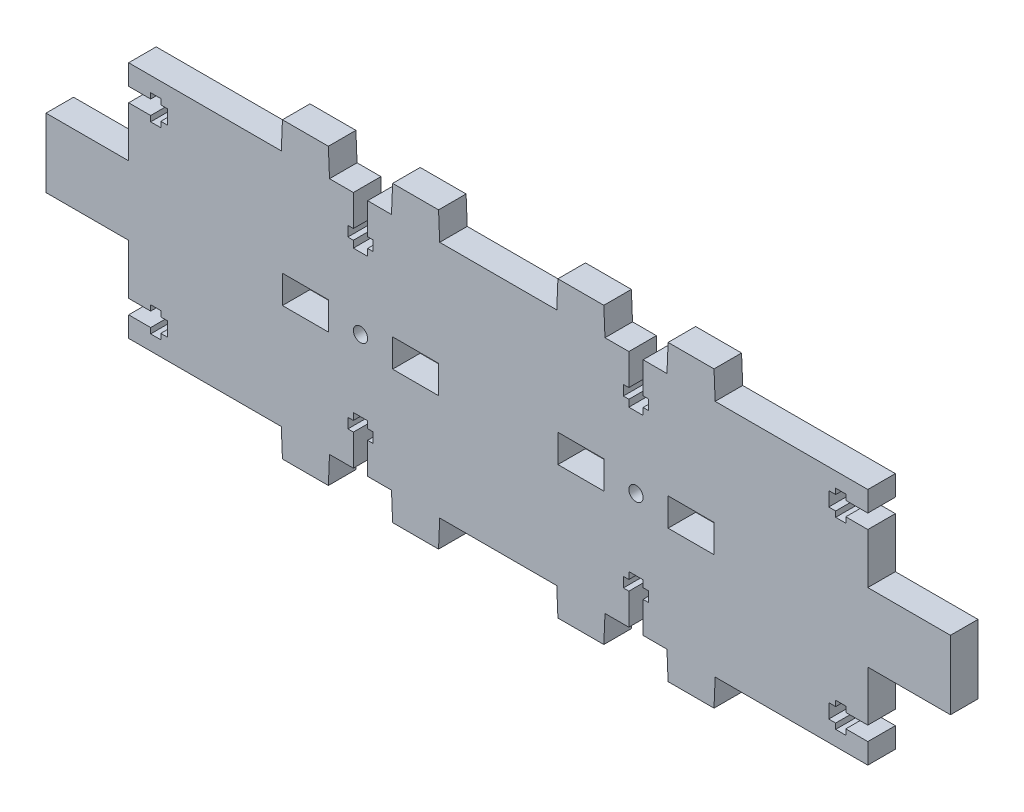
from build123d import *

# Parameters (mm, degrees)
SKETCH_1_R      = 1.55
SKETCH_1_W      = 10
SKETCH_1_H      = 6.1
EXTRUDE_1_DEPTH = 6


with BuildPart() as part:
    # Sketch 1 → Extrude 1 (new body)
    with BuildSketch(Plane.XY):
        Polygon((0, 0), (12.75, 0), (13, -6), (23, -6), (23.25, 0), (28.45, 0), (28.45, 6.8), (27.25, 6.8), (27.25, 9), (28.45, 9), (28.45, 10.5), (31.55, 10.5), (31.55, 9), (32.75, 9), (32.75, 6.8), (31.55, 6.8), (31.55, 0), (36.75, 0), (37, -6), (47, -6), (47.25, 0), (80.5, 0), (80.5, 4.45), (75.7, 4.45), (75.7, 3.25), (73.5, 3.25), (73.5, 4.45), (72, 4.45), (72, 7.55), (73.5, 7.55), (73.5, 8.75), (75.7, 8.75), (75.7, 7.55), (80.5, 7.55), (80.5, 18.5), (98.5, 18.5), (98.5, 33.5), (80.5, 33.5), (80.5, 44.45), (75.7, 44.45), (75.7, 43.25), (73.5, 43.25), (73.5, 44.45), (72, 44.45), (72, 47.55), (73.5, 47.55), (73.5, 48.75), (75.7, 48.75), (75.7, 47.55), (80.5, 47.55), (80.5, 52), (47.25, 52), (47, 58), (37, 58), (36.75, 52), (31.55, 52), (31.55, 45.2), (32.75, 45.2), (32.75, 43), (31.55, 43), (31.55, 41.5), (28.45, 41.5), (28.45, 43), (27.25, 43), (27.25, 45.2), (28.45, 45.2), (28.45, 52), (23.25, 52), (23, 58), (13, 58), (12.75, 52), (0, 52), align=None)
        with Locations((30, 26)):
            Circle(SKETCH_1_R, mode=Mode.SUBTRACT)
        with Locations((18, 26)):
            Rectangle(SKETCH_1_W, SKETCH_1_H, mode=Mode.SUBTRACT)
        with Locations((42, 26)):
            Rectangle(SKETCH_1_W, SKETCH_1_H, mode=Mode.SUBTRACT)
    extrude(amount=EXTRUDE_1_DEPTH)

    # Mirror 1: part across plane


with BuildPart() as part_1:
    add(part.part)
    add(part.part.mirror(Plane(origin=(0, 0, 6), x_dir=(0, 0, 1), z_dir=(1, 0, 0))))


solid = part_1.part
